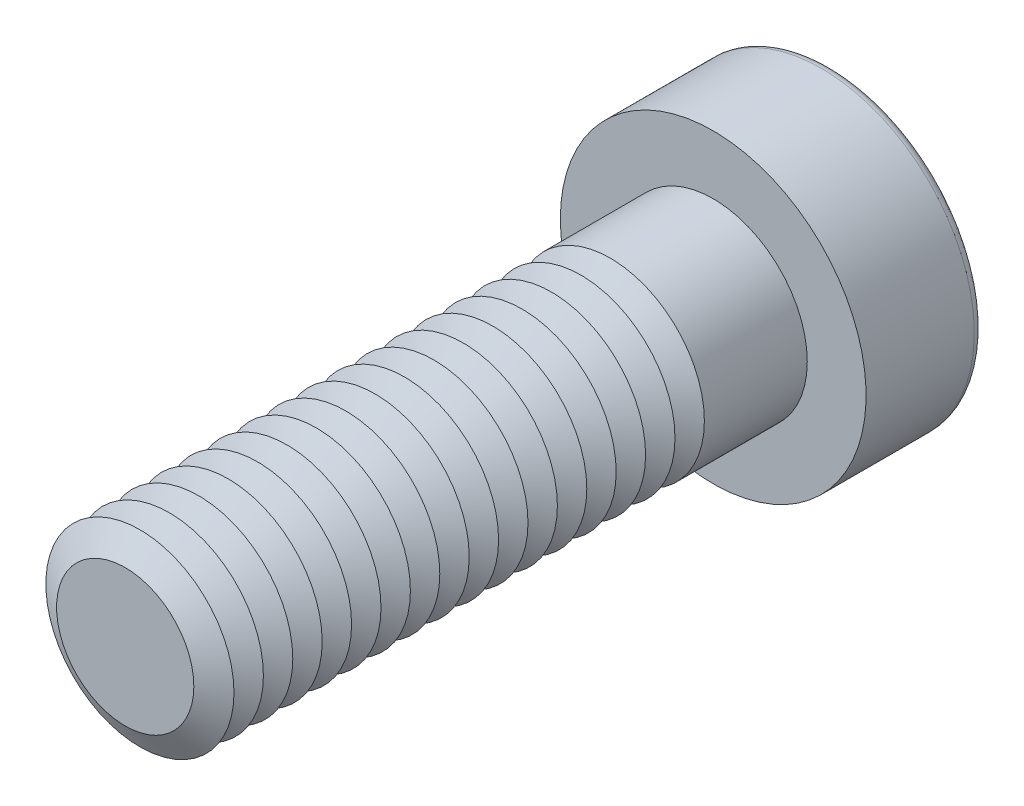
from build123d import *

# Parameters (mm, degrees)
SKETCH1_R           = 4
BOSS_EXTRUDE1_DEPTH = 25
SKETCH2_R           = 6.5
BOSS_EXTRUDE2_DEPTH = 5
CUT_EXTRUDE1_DEPTH  = 3.75
FILLET1_R           = 0.4
LPATTERN1_COUNT     = 17
LPATTERN1_PITCH     = 1.25


with BuildPart() as part:
    # Sketch1 → Boss-Extrude1 (new body)
    with BuildSketch(Plane.XY):
        Circle(SKETCH1_R)
    extrude(amount=BOSS_EXTRUDE1_DEPTH)

    # Sketch2 → Boss-Extrude2 (add)
    with BuildSketch(Plane(origin=(0, 0, 0), x_dir=(-1, 0, 0), z_dir=(0, 0, -1))):
        Circle(SKETCH2_R)
    extrude(amount=BOSS_EXTRUDE2_DEPTH)

    # Sketch3 → Cut-Extrude1 (cut)
    with BuildSketch(Plane(origin=(0, 0, -5), x_dir=(-1, 0, 0), z_dir=(0, 0, -1))):
        Polygon((-1.443375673, 2.5), (-2.886751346, 0), (-1.443375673, -2.5), (1.443375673, -2.5), (2.886751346, 0), (1.443375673, 2.5), align=None)
    extrude(amount=-CUT_EXTRUDE1_DEPTH, mode=Mode.SUBTRACT)

    # Fillet1
    fillet1_edges = [part.edges().sort_by_distance(p)[0] for p in [
        (6.5, 0, -5),
    ]]
    fillet(fillet1_edges, radius=FILLET1_R)

    # Cut-Extrude2 cone 1 section (on through the dimple's axis) → Cut-Extrude2 (revolve, cut)
    with BuildSketch(Plane(origin=(0, 0, -1.25), x_dir=(0, 1, 0), z_dir=(1, 0, 0))):
        Polygon((0, 0), (2.5, 0), (0, 1.443375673), align=None)
    revolve(axis=Axis((0, 0, -1.25), (0, 0, 1)), mode=Mode.SUBTRACT)

    # Cut-Extrude3 cone 1 section (on through the dimple's axis) → Cut-Extrude3 (revolve, cut)
    with BuildSketch(Plane(origin=(0, 0, -5), x_dir=(0, 1, 0), z_dir=(1, 0, 0))):
        Polygon((0, 0), (2.886751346, 0), (0, 0.773502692), align=None)
    revolve(axis=Axis((0, 0, -5), (0, 0, 1)), mode=Mode.SUBTRACT)

    # Sketch7 → Cut-Revolve1 (revolve, cut)
    with BuildSketch(Plane(origin=(0, 0, 0), x_dir=(0, 0, -1), z_dir=(1, 0, 0)), mode=Mode.PRIVATE) as cut_revolve1_sk:
        Polygon((-25, 2.917468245), (-24.375, 4), (-25.625, 4), align=None)
    cut_revolve1 = revolve(cut_revolve1_sk.sketch.rotate(Axis((0, 0, 25), (0, 0, -1)), 90), axis=Axis((0, 0, 25), (0, 0, -1)), mode=Mode.SUBTRACT)

    # LPattern1: Cut-Revolve1 ×17
    with Locations(*[(0, 0, -i * LPATTERN1_PITCH) for i in range(1, LPATTERN1_COUNT)]):
        add(cut_revolve1, mode=Mode.SUBTRACT)


solid = part.part
